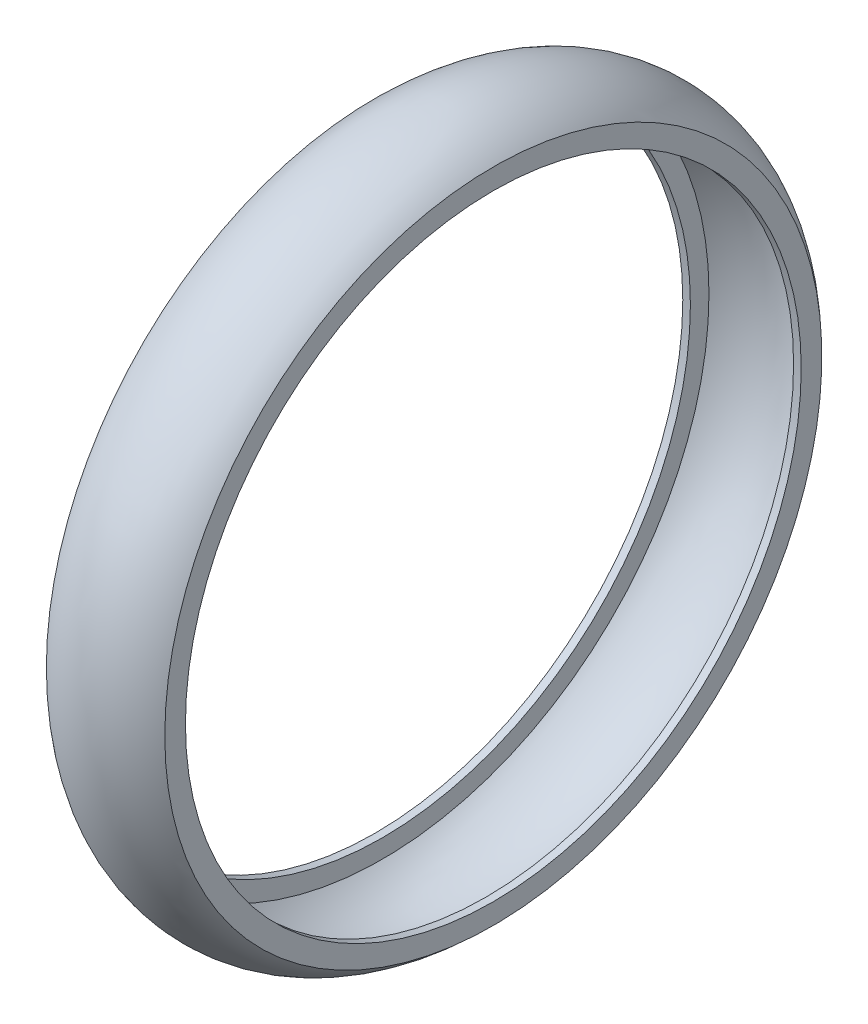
ISO-10303-21;
HEADER;
FILE_DESCRIPTION(('STEP AP214'),'2;1');
FILE_NAME('part.step','',(''),(''),'','','');
FILE_SCHEMA(('AUTOMOTIVE_DESIGN { 1 0 10303 214 1 1 1 1 }'));
ENDSEC;
DATA;
#1=APPLICATION_CONTEXT('core data for automotive mechanical design processes');
#2=APPLICATION_PROTOCOL_DEFINITION('international standard','automotive_design',2000,#1);
#3=PRODUCT_CONTEXT('',#1,'mechanical');
#4=PRODUCT('Part','Part','',(#3));
#5=PRODUCT_RELATED_PRODUCT_CATEGORY('part','',(#4));
#6=PRODUCT_DEFINITION_FORMATION('','',#4);
#7=PRODUCT_DEFINITION_CONTEXT('part definition',#1,'design');
#8=PRODUCT_DEFINITION('design','',#6,#7);
#9=PRODUCT_DEFINITION_SHAPE('','',#8);
#10=(LENGTH_UNIT() NAMED_UNIT(*) SI_UNIT(.MILLI.,.METRE.));
#11=(NAMED_UNIT(*) PLANE_ANGLE_UNIT() SI_UNIT($,.RADIAN.));
#12=(NAMED_UNIT(*) SI_UNIT($,.STERADIAN.) SOLID_ANGLE_UNIT());
#13=UNCERTAINTY_MEASURE_WITH_UNIT(LENGTH_MEASURE(1.E-05),#10,'distance_accuracy_value','');
#14=(GEOMETRIC_REPRESENTATION_CONTEXT(3) GLOBAL_UNCERTAINTY_ASSIGNED_CONTEXT((#13)) GLOBAL_UNIT_ASSIGNED_CONTEXT((#10,
#11,#12)) REPRESENTATION_CONTEXT('',''));
#15=CARTESIAN_POINT('',(0.,0.,0.));
#16=DIRECTION('',(0.,0.,1.));
#17=DIRECTION('',(1.,0.,0.));
#18=AXIS2_PLACEMENT_3D('',#15,#16,#17);
#19=CARTESIAN_POINT('',(5.73829377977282,-31.8347084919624,0.));
#20=DIRECTION('',(-1.,0.,0.));
#21=DIRECTION('',(0.,0.,1.));
#22=AXIS2_PLACEMENT_3D('',#19,#20,#21);
#23=TOROIDAL_SURFACE('',#22,25.5089795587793,7.90724699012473);
#24=CARTESIAN_POINT('',(10.7382937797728,-31.8347084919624,0.));
#25=DIRECTION('',(-1.,0.,0.));
#26=DIRECTION('',(0.,0.,1.));
#27=AXIS2_PLACEMENT_3D('',#24,#25,#26);
#28=CIRCLE('',#27,31.6347084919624);
#29=CARTESIAN_POINT('',(10.7382937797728,-31.8347084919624,31.6347084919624));
#30=VERTEX_POINT('',#29);
#31=EDGE_CURVE('E19',#30,#30,#28,.F.);
#32=ORIENTED_EDGE('',*,*,#31,.T.);
#33=EDGE_LOOP('',(#32));
#34=FACE_BOUND('',#33,.T.);
#35=CARTESIAN_POINT('',(0.738293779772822,-31.8347084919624,0.));
#36=DIRECTION('',(-1.,0.,0.));
#37=DIRECTION('',(0.,0.,1.));
#38=AXIS2_PLACEMENT_3D('',#35,#36,#37);
#39=CIRCLE('',#38,31.6347084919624);
#40=CARTESIAN_POINT('',(0.738293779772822,-31.8347084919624,31.6347084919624));
#41=VERTEX_POINT('',#40);
#42=EDGE_CURVE('E50',#41,#41,#39,.T.);
#43=ORIENTED_EDGE('',*,*,#42,.T.);
#44=EDGE_LOOP('',(#43));
#45=FACE_BOUND('',#44,.T.);
#46=ADVANCED_FACE('F15',(#34,#45),#23,.F.);
#47=CARTESIAN_POINT('',(10.7382937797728,-2.,0.));
#48=DIRECTION('',(1.,0.,0.));
#49=DIRECTION('',(0.,0.,-1.));
#50=AXIS2_PLACEMENT_3D('',#47,#48,#49);
#51=PLANE('',#50);
#52=ORIENTED_EDGE('',*,*,#31,.F.);
#53=EDGE_LOOP('',(#52));
#54=FACE_BOUND('',#53,.T.);
#55=CARTESIAN_POINT('',(10.7382937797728,-31.8347084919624,0.));
#56=DIRECTION('',(-1.,0.,0.));
#57=DIRECTION('',(0.,0.,1.));
#58=AXIS2_PLACEMENT_3D('',#55,#56,#57);
#59=CIRCLE('',#58,29.8347084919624);
#60=CARTESIAN_POINT('',(10.7382937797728,-31.8347084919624,29.8347084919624));
#61=VERTEX_POINT('',#60);
#62=EDGE_CURVE('E47',#61,#61,#59,.F.);
#63=ORIENTED_EDGE('',*,*,#62,.T.);
#64=EDGE_LOOP('',(#63));
#65=FACE_BOUND('',#64,.T.);
#66=ADVANCED_FACE('F60',(#54,#65),#51,.F.);
#67=CARTESIAN_POINT('',(0.738293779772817,-2.,0.));
#68=DIRECTION('',(-1.,0.,0.));
#69=DIRECTION('',(0.,0.,1.));
#70=AXIS2_PLACEMENT_3D('',#67,#68,#69);
#71=PLANE('',#70);
#72=CARTESIAN_POINT('',(0.738293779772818,-31.8347084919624,0.));
#73=DIRECTION('',(-1.,0.,0.));
#74=DIRECTION('',(0.,0.,1.));
#75=AXIS2_PLACEMENT_3D('',#72,#73,#74);
#76=CIRCLE('',#75,29.8347084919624);
#77=CARTESIAN_POINT('',(0.738293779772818,-31.8347084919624,29.8347084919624));
#78=VERTEX_POINT('',#77);
#79=EDGE_CURVE('E43',#78,#78,#76,.T.);
#80=ORIENTED_EDGE('',*,*,#79,.T.);
#81=EDGE_LOOP('',(#80));
#82=FACE_BOUND('',#81,.T.);
#83=ORIENTED_EDGE('',*,*,#42,.F.);
#84=EDGE_LOOP('',(#83));
#85=FACE_BOUND('',#84,.T.);
#86=ADVANCED_FACE('F63',(#82,#85),#71,.F.);
#87=CARTESIAN_POINT('',(5.,-31.8347084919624,0.));
#88=DIRECTION('',(-1.,0.,0.));
#89=DIRECTION('',(0.,0.,1.));
#90=AXIS2_PLACEMENT_3D('',#87,#88,#89);
#91=CYLINDRICAL_SURFACE('',#90,29.8347084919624);
#92=CARTESIAN_POINT('',(11.4765875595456,-31.8347084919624,0.));
#93=DIRECTION('',(-1.,0.,0.));
#94=DIRECTION('',(0.,0.,1.));
#95=AXIS2_PLACEMENT_3D('',#92,#93,#94);
#96=CIRCLE('',#95,29.8347084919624);
#97=CARTESIAN_POINT('',(11.4765875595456,-31.8347084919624,29.8347084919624));
#98=VERTEX_POINT('',#97);
#99=EDGE_CURVE('E39',#98,#98,#96,.F.);
#100=ORIENTED_EDGE('',*,*,#99,.T.);
#101=EDGE_LOOP('',(#100));
#102=FACE_BOUND('',#101,.T.);
#103=ORIENTED_EDGE('',*,*,#62,.F.);
#104=EDGE_LOOP('',(#103));
#105=FACE_BOUND('',#104,.T.);
#106=ADVANCED_FACE('F66',(#102,#105),#91,.F.);
#107=CARTESIAN_POINT('',(5.,-31.8347084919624,0.));
#108=DIRECTION('',(-1.,0.,0.));
#109=DIRECTION('',(0.,0.,1.));
#110=AXIS2_PLACEMENT_3D('',#107,#108,#109);
#111=CYLINDRICAL_SURFACE('',#110,29.8347084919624);
#112=ORIENTED_EDGE('',*,*,#79,.F.);
#113=EDGE_LOOP('',(#112));
#114=FACE_BOUND('',#113,.T.);
#115=CARTESIAN_POINT('',(0.,-31.8347084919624,0.));
#116=DIRECTION('',(-1.,0.,0.));
#117=DIRECTION('',(0.,0.,1.));
#118=AXIS2_PLACEMENT_3D('',#115,#116,#117);
#119=CIRCLE('',#118,29.8347084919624);
#120=CARTESIAN_POINT('',(0.,-31.8347084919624,29.8347084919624));
#121=VERTEX_POINT('',#120);
#122=EDGE_CURVE('E31',#121,#121,#119,.T.);
#123=ORIENTED_EDGE('',*,*,#122,.T.);
#124=EDGE_LOOP('',(#123));
#125=FACE_BOUND('',#124,.T.);
#126=ADVANCED_FACE('F68',(#114,#125),#111,.F.);
#127=CARTESIAN_POINT('',(11.4765875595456,0.,0.));
#128=DIRECTION('',(-1.,0.,0.));
#129=DIRECTION('',(0.,0.,1.));
#130=AXIS2_PLACEMENT_3D('',#127,#128,#129);
#131=PLANE('',#130);
#132=ORIENTED_EDGE('',*,*,#99,.F.);
#133=EDGE_LOOP('',(#132));
#134=FACE_BOUND('',#133,.T.);
#135=CARTESIAN_POINT('',(11.4765875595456,-31.8347084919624,0.));
#136=DIRECTION('',(-1.,0.,0.));
#137=DIRECTION('',(0.,0.,1.));
#138=AXIS2_PLACEMENT_3D('',#135,#136,#137);
#139=CIRCLE('',#138,31.8347084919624);
#140=CARTESIAN_POINT('',(11.4765875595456,-31.8347084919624,31.8347084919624));
#141=VERTEX_POINT('',#140);
#142=EDGE_CURVE('E24',#141,#141,#139,.T.);
#143=ORIENTED_EDGE('',*,*,#142,.F.);
#144=EDGE_LOOP('',(#143));
#145=FACE_BOUND('',#144,.T.);
#146=ADVANCED_FACE('F76',(#134,#145),#131,.F.);
#147=CARTESIAN_POINT('',(0.,0.,0.));
#148=DIRECTION('',(1.,0.,0.));
#149=DIRECTION('',(0.,0.,-1.));
#150=AXIS2_PLACEMENT_3D('',#147,#148,#149);
#151=PLANE('',#150);
#152=CARTESIAN_POINT('',(0.,-31.8347084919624,0.));
#153=DIRECTION('',(-1.,0.,0.));
#154=DIRECTION('',(0.,0.,1.));
#155=AXIS2_PLACEMENT_3D('',#152,#153,#154);
#156=CIRCLE('',#155,31.8347084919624);
#157=CARTESIAN_POINT('',(0.,-31.8347084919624,31.8347084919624));
#158=VERTEX_POINT('',#157);
#159=EDGE_CURVE('E10',#158,#158,#156,.F.);
#160=ORIENTED_EDGE('',*,*,#159,.F.);
#161=EDGE_LOOP('',(#160));
#162=FACE_BOUND('',#161,.T.);
#163=ORIENTED_EDGE('',*,*,#122,.F.);
#164=EDGE_LOOP('',(#163));
#165=FACE_BOUND('',#164,.T.);
#166=ADVANCED_FACE('F83',(#162,#165),#151,.F.);
#167=CARTESIAN_POINT('',(5.73829377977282,-31.8347084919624,0.));
#168=DIRECTION('',(-1.,0.,0.));
#169=DIRECTION('',(0.,0.,1.));
#170=AXIS2_PLACEMENT_3D('',#167,#168,#169);
#171=TOROIDAL_SURFACE('',#170,26.0964147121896,8.11517288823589);
#172=ORIENTED_EDGE('',*,*,#159,.T.);
#173=EDGE_LOOP('',(#172));
#174=FACE_BOUND('',#173,.T.);
#175=ORIENTED_EDGE('',*,*,#142,.T.);
#176=EDGE_LOOP('',(#175));
#177=FACE_BOUND('',#176,.T.);
#178=ADVANCED_FACE('F81',(#174,#177),#171,.T.);
#179=CLOSED_SHELL('',(#46,#66,#86,#106,#126,#146,#166,#178));
#180=MANIFOLD_SOLID_BREP('B1',#179);
#181=ADVANCED_BREP_SHAPE_REPRESENTATION('',(#18,#180),#14);
#182=SHAPE_DEFINITION_REPRESENTATION(#9,#181);
ENDSEC;
END-ISO-10303-21;
